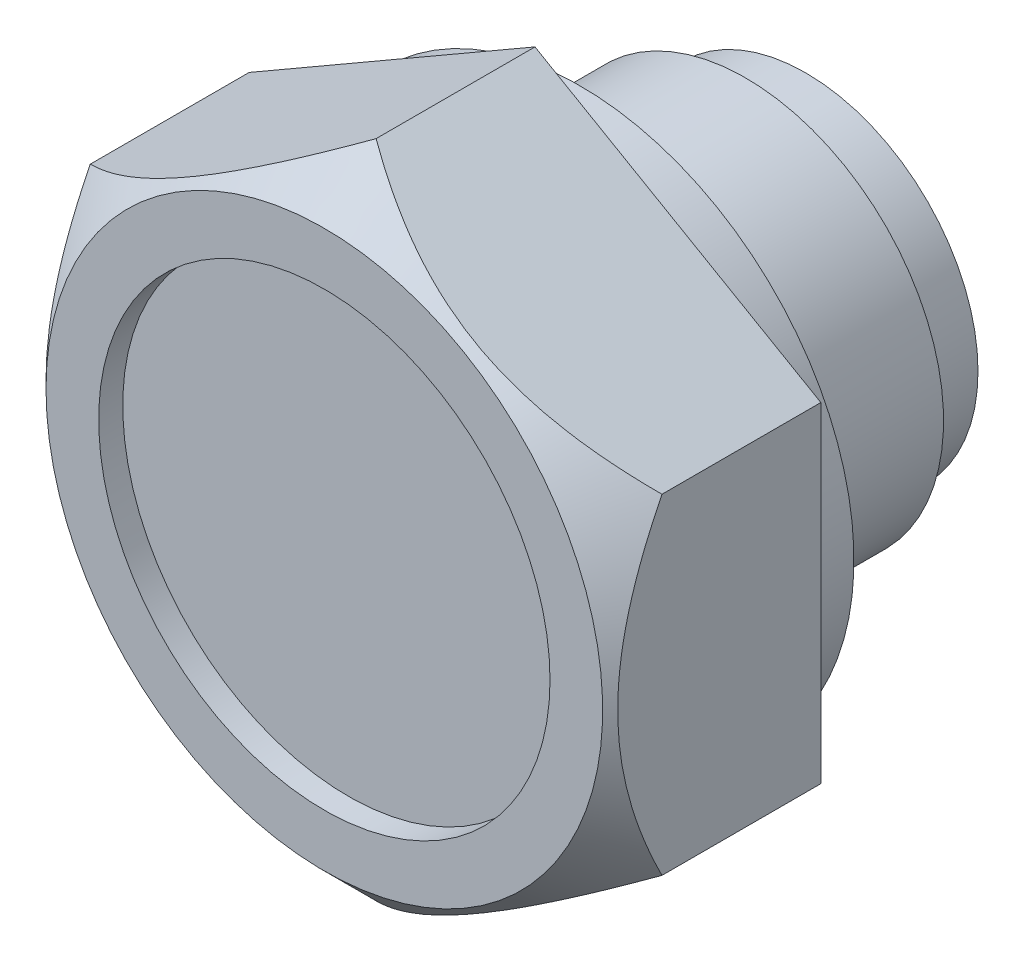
ISO-10303-21;
HEADER;
FILE_DESCRIPTION(('STEP AP214'),'2;1');
FILE_NAME('part.step','',(''),(''),'','','');
FILE_SCHEMA(('AUTOMOTIVE_DESIGN { 1 0 10303 214 1 1 1 1 }'));
ENDSEC;
DATA;
#1=APPLICATION_CONTEXT('core data for automotive mechanical design processes');
#2=APPLICATION_PROTOCOL_DEFINITION('international standard','automotive_design',2000,#1);
#3=PRODUCT_CONTEXT('',#1,'mechanical');
#4=PRODUCT('Part','Part','',(#3));
#5=PRODUCT_RELATED_PRODUCT_CATEGORY('part','',(#4));
#6=PRODUCT_DEFINITION_FORMATION('','',#4);
#7=PRODUCT_DEFINITION_CONTEXT('part definition',#1,'design');
#8=PRODUCT_DEFINITION('design','',#6,#7);
#9=PRODUCT_DEFINITION_SHAPE('','',#8);
#10=(LENGTH_UNIT() NAMED_UNIT(*) SI_UNIT(.MILLI.,.METRE.));
#11=(NAMED_UNIT(*) PLANE_ANGLE_UNIT() SI_UNIT($,.RADIAN.));
#12=(NAMED_UNIT(*) SI_UNIT($,.STERADIAN.) SOLID_ANGLE_UNIT());
#13=UNCERTAINTY_MEASURE_WITH_UNIT(LENGTH_MEASURE(1.E-05),#10,'distance_accuracy_value','');
#14=(GEOMETRIC_REPRESENTATION_CONTEXT(3) GLOBAL_UNCERTAINTY_ASSIGNED_CONTEXT((#13)) GLOBAL_UNIT_ASSIGNED_CONTEXT((#10,
#11,#12)) REPRESENTATION_CONTEXT('',''));
#15=CARTESIAN_POINT('',(0.,0.,0.));
#16=DIRECTION('',(0.,0.,1.));
#17=DIRECTION('',(1.,0.,0.));
#18=AXIS2_PLACEMENT_3D('',#15,#16,#17);
#19=CARTESIAN_POINT('',(0.,9.1,1.5));
#20=DIRECTION('',(0.,0.,-1.));
#21=DIRECTION('',(-1.,0.,0.));
#22=AXIS2_PLACEMENT_3D('',#19,#20,#21);
#23=PLANE('',#22);
#24=CARTESIAN_POINT('',(0.,0.,1.5));
#25=DIRECTION('',(0.,0.,-1.));
#26=DIRECTION('',(-1.,0.,0.));
#27=AXIS2_PLACEMENT_3D('',#24,#25,#26);
#28=CIRCLE('',#27,9.1);
#29=CARTESIAN_POINT('',(-9.1,0.,1.5));
#30=VERTEX_POINT('',#29);
#31=EDGE_CURVE('E194',#30,#30,#28,.T.);
#32=ORIENTED_EDGE('',*,*,#31,.F.);
#33=EDGE_LOOP('',(#32));
#34=FACE_BOUND('',#33,.T.);
#35=DIRECTION('',(-0.866025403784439,-0.5,0.));
#36=VECTOR('',#35,1.);
#37=CARTESIAN_POINT('',(-0.809584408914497,10.5022413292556,1.5));
#38=LINE('',#37,#36);
#39=CARTESIAN_POINT('',(-2.35150440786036E-11,10.9696551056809,1.5));
#40=VERTEX_POINT('',#39);
#41=CARTESIAN_POINT('',(-9.49999999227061,5.4848275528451,1.5));
#42=VERTEX_POINT('',#41);
#43=EDGE_CURVE('E9',#40,#42,#38,.T.);
#44=ORIENTED_EDGE('',*,*,#43,.F.);
#45=DIRECTION('',(-0.866025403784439,0.5,0.));
#46=VECTOR('',#45,1.);
#47=CARTESIAN_POINT('',(0.809584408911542,10.5022413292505,1.5));
#48=LINE('',#47,#46);
#49=CARTESIAN_POINT('',(9.49999999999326,5.48482753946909,1.5));
#50=VERTEX_POINT('',#49);
#51=EDGE_CURVE('E22',#50,#40,#48,.T.);
#52=ORIENTED_EDGE('',*,*,#51,.F.);
#53=DIRECTION('',(7.05455308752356E-10,1.,0.));
#54=VECTOR('',#53,1.);
#55=CARTESIAN_POINT('',(9.5000000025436,9.0999999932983,1.5));
#56=LINE('',#55,#54);
#57=CARTESIAN_POINT('',(9.49999999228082,-5.48482755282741,1.5));
#58=VERTEX_POINT('',#57);
#59=EDGE_CURVE('E205',#58,#50,#56,.T.);
#60=ORIENTED_EDGE('',*,*,#59,.F.);
#61=DIRECTION('',(0.866025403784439,0.5,0.));
#62=VECTOR('',#61,1.);
#63=CARTESIAN_POINT('',(8.69041558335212,-5.9522413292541,1.5));
#64=LINE('',#63,#62);
#65=CARTESIAN_POINT('',(7.9060022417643E-12,-10.9696551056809,1.5));
#66=VERTEX_POINT('',#65);
#67=EDGE_CURVE('E37',#66,#58,#64,.T.);
#68=ORIENTED_EDGE('',*,*,#67,.F.);
#69=DIRECTION('',(0.866025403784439,-0.5,0.));
#70=VECTOR('',#69,1.);
#71=CARTESIAN_POINT('',(-8.69041558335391,-5.9522413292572,1.5));
#72=LINE('',#71,#70);
#73=CARTESIAN_POINT('',(-9.49999999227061,-5.48482755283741,1.5));
#74=VERTEX_POINT('',#73);
#75=EDGE_CURVE('E65',#74,#66,#72,.T.);
#76=ORIENTED_EDGE('',*,*,#75,.F.);
#77=DIRECTION('',(0.,-1.,0.));
#78=VECTOR('',#77,1.);
#79=CARTESIAN_POINT('',(-9.49999999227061,9.1,1.5));
#80=LINE('',#79,#78);
#81=EDGE_CURVE('E66',#42,#74,#80,.T.);
#82=ORIENTED_EDGE('',*,*,#81,.F.);
#83=EDGE_LOOP('',(#44,#52,#60,#68,#76,#82));
#84=FACE_BOUND('',#83,.T.);
#85=ADVANCED_FACE('F14',(#34,#84),#23,.T.);
#86=CARTESIAN_POINT('',(0.,0.,-7.5));
#87=DIRECTION('',(0.,0.,-1.));
#88=DIRECTION('',(-1.,0.,0.));
#89=AXIS2_PLACEMENT_3D('',#86,#87,#88);
#90=PLANE('',#89);
#91=CARTESIAN_POINT('',(0.,0.,-7.5));
#92=DIRECTION('',(0.,0.,-1.));
#93=DIRECTION('',(-1.,0.,0.));
#94=AXIS2_PLACEMENT_3D('',#91,#92,#93);
#95=CIRCLE('',#94,5.72250000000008);
#96=CARTESIAN_POINT('',(-5.72250000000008,0.,-7.5));
#97=VERTEX_POINT('',#96);
#98=EDGE_CURVE('E213',#97,#97,#95,.T.);
#99=ORIENTED_EDGE('',*,*,#98,.T.);
#100=EDGE_LOOP('',(#99));
#101=FACE_BOUND('',#100,.T.);
#102=ADVANCED_FACE('F16',(#101),#90,.T.);
#103=CARTESIAN_POINT('',(0.,0.,-9.68228561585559));
#104=DIRECTION('',(0.,0.,-1.));
#105=DIRECTION('',(-1.,0.,0.));
#106=AXIS2_PLACEMENT_3D('',#103,#104,#105);
#107=CYLINDRICAL_SURFACE('',#106,9.1);
#108=ORIENTED_EDGE('',*,*,#31,.T.);
#109=EDGE_LOOP('',(#108));
#110=FACE_BOUND('',#109,.T.);
#111=CARTESIAN_POINT('',(0.,0.,0.));
#112=DIRECTION('',(0.,0.,-1.));
#113=DIRECTION('',(-1.,0.,0.));
#114=AXIS2_PLACEMENT_3D('',#111,#112,#113);
#115=CIRCLE('',#114,9.1);
#116=CARTESIAN_POINT('',(-9.1,0.,0.));
#117=VERTEX_POINT('',#116);
#118=EDGE_CURVE('E195',#117,#117,#115,.T.);
#119=ORIENTED_EDGE('',*,*,#118,.F.);
#120=EDGE_LOOP('',(#119));
#121=FACE_BOUND('',#120,.T.);
#122=ADVANCED_FACE('F176',(#110,#121),#107,.T.);
#123=CARTESIAN_POINT('',(0.,6.5785,0.));
#124=DIRECTION('',(0.,0.,-1.));
#125=DIRECTION('',(-1.,0.,0.));
#126=AXIS2_PLACEMENT_3D('',#123,#124,#125);
#127=PLANE('',#126);
#128=ORIENTED_EDGE('',*,*,#118,.T.);
#129=EDGE_LOOP('',(#128));
#130=FACE_BOUND('',#129,.T.);
#131=CARTESIAN_POINT('',(0.,0.,0.));
#132=DIRECTION('',(0.,0.,-1.));
#133=DIRECTION('',(-1.,0.,0.));
#134=AXIS2_PLACEMENT_3D('',#131,#132,#133);
#135=CIRCLE('',#134,6.57850000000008);
#136=CARTESIAN_POINT('',(-6.57850000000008,0.,0.));
#137=VERTEX_POINT('',#136);
#138=EDGE_CURVE('E200',#137,#137,#135,.T.);
#139=ORIENTED_EDGE('',*,*,#138,.F.);
#140=EDGE_LOOP('',(#139));
#141=FACE_BOUND('',#140,.T.);
#142=ADVANCED_FACE('F173',(#130,#141),#127,.T.);
#143=CARTESIAN_POINT('',(0.,0.,-9.68228561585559));
#144=DIRECTION('',(0.,0.,-1.));
#145=DIRECTION('',(-1.,0.,0.));
#146=AXIS2_PLACEMENT_3D('',#143,#144,#145);
#147=CYLINDRICAL_SURFACE('',#146,6.57850000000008);
#148=CARTESIAN_POINT('',(0.,0.,-5.5));
#149=DIRECTION('',(0.,0.,-1.));
#150=DIRECTION('',(-1.,0.,0.));
#151=AXIS2_PLACEMENT_3D('',#148,#149,#150);
#152=CIRCLE('',#151,6.5785);
#153=CARTESIAN_POINT('',(-6.5785,0.,-5.5));
#154=VERTEX_POINT('',#153);
#155=EDGE_CURVE('E218',#154,#154,#152,.T.);
#156=ORIENTED_EDGE('',*,*,#155,.F.);
#157=EDGE_LOOP('',(#156));
#158=FACE_BOUND('',#157,.T.);
#159=ORIENTED_EDGE('',*,*,#138,.T.);
#160=EDGE_LOOP('',(#159));
#161=FACE_BOUND('',#160,.T.);
#162=ADVANCED_FACE('F169',(#158,#161),#147,.T.);
#163=CARTESIAN_POINT('',(0.,5.7225,-5.5));
#164=DIRECTION('',(0.,0.,-1.));
#165=DIRECTION('',(-1.,0.,0.));
#166=AXIS2_PLACEMENT_3D('',#163,#164,#165);
#167=PLANE('',#166);
#168=ORIENTED_EDGE('',*,*,#155,.T.);
#169=EDGE_LOOP('',(#168));
#170=FACE_BOUND('',#169,.T.);
#171=CARTESIAN_POINT('',(0.,0.,-5.5));
#172=DIRECTION('',(0.,0.,-1.));
#173=DIRECTION('',(-1.,0.,0.));
#174=AXIS2_PLACEMENT_3D('',#171,#172,#173);
#175=CIRCLE('',#174,5.72250000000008);
#176=CARTESIAN_POINT('',(-5.72250000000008,0.,-5.5));
#177=VERTEX_POINT('',#176);
#178=EDGE_CURVE('E215',#177,#177,#175,.T.);
#179=ORIENTED_EDGE('',*,*,#178,.F.);
#180=EDGE_LOOP('',(#179));
#181=FACE_BOUND('',#180,.T.);
#182=ADVANCED_FACE('F165',(#170,#181),#167,.T.);
#183=CARTESIAN_POINT('',(0.,0.,-9.68228561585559));
#184=DIRECTION('',(0.,0.,-1.));
#185=DIRECTION('',(-1.,0.,0.));
#186=AXIS2_PLACEMENT_3D('',#183,#184,#185);
#187=CYLINDRICAL_SURFACE('',#186,5.72250000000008);
#188=ORIENTED_EDGE('',*,*,#98,.F.);
#189=EDGE_LOOP('',(#188));
#190=FACE_BOUND('',#189,.T.);
#191=ORIENTED_EDGE('',*,*,#178,.T.);
#192=EDGE_LOOP('',(#191));
#193=FACE_BOUND('',#192,.T.);
#194=ADVANCED_FACE('F162',(#190,#193),#187,.T.);
#195=CARTESIAN_POINT('',(-9.49999999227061,5.48482755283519,-7.5));
#196=DIRECTION('',(0.5,-0.866025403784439,0.));
#197=DIRECTION('',(-0.866025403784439,-0.5,0.));
#198=AXIS2_PLACEMENT_3D('',#195,#196,#197);
#199=PLANE('',#198);
#200=CARTESIAN_POINT('',(0.000199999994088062,10.9697705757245,6.7802294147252));
#201=CARTESIAN_POINT('',(-0.163127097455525,10.875473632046,6.87451305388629));
#202=CARTESIAN_POINT('',(-0.32773331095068,10.7804381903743,6.96591968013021));
#203=CARTESIAN_POINT('',(-0.659703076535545,10.588775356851,7.14206501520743));
#204=CARTESIAN_POINT('',(-0.827068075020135,10.492147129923,7.22680008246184));
#205=CARTESIAN_POINT('',(-1.16554392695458,10.2967280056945,7.38904726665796));
#206=CARTESIAN_POINT('',(-1.33667074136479,10.1979278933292,7.46651524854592));
#207=CARTESIAN_POINT('',(-1.68173507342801,9.99870490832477,7.61254572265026));
#208=CARTESIAN_POINT('',(-1.85567215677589,9.89828228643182,7.6811095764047));
#209=CARTESIAN_POINT('',(-2.20356038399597,9.6974289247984,7.80716241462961));
#210=CARTESIAN_POINT('',(-2.37746877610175,9.59702286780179,7.86480781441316));
#211=CARTESIAN_POINT('',(-2.7277234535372,9.39480323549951,7.96916953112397));
#212=CARTESIAN_POINT('',(-2.90406947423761,9.29298981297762,8.01588702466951));
#213=CARTESIAN_POINT('',(-3.25844512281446,9.08839093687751,8.09721676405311));
#214=CARTESIAN_POINT('',(-3.43647001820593,8.98560821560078,8.13185625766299));
#215=CARTESIAN_POINT('',(-3.79401438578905,8.77917987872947,8.18826883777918));
#216=CARTESIAN_POINT('',(-3.97353363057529,8.67553439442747,8.21004384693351));
#217=CARTESIAN_POINT('',(-4.41100623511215,8.42295946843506,8.24655435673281));
#218=CARTESIAN_POINT('',(-4.66943244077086,8.27375702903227,8.25421609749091));
#219=CARTESIAN_POINT('',(-5.18581747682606,7.97562198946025,8.24135626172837));
#220=CARTESIAN_POINT('',(-5.44377611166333,7.82668950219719,8.22082480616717));
#221=CARTESIAN_POINT('',(-5.95726173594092,7.53022843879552,8.15279045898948));
#222=CARTESIAN_POINT('',(-6.21278568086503,7.38270162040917,8.10525740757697));
#223=CARTESIAN_POINT('',(-6.71944160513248,7.09018368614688,7.98580361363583));
#224=CARTESIAN_POINT('',(-6.97057391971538,6.94519237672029,7.9138847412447));
#225=CARTESIAN_POINT('',(-7.41636798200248,6.68781305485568,7.76592936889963));
#226=CARTESIAN_POINT('',(-7.61201705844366,6.57485500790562,7.69378482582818));
#227=CARTESIAN_POINT('',(-7.99980326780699,6.35096653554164,7.53787046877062));
#228=CARTESIAN_POINT('',(-8.19194029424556,6.24003617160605,7.45410030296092));
#229=CARTESIAN_POINT('',(-8.57209722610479,6.02055246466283,7.27681237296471));
#230=CARTESIAN_POINT('',(-8.76012794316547,5.91199287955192,7.18332526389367));
#231=CARTESIAN_POINT('',(-9.13270777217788,5.69688381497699,6.98783068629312));
#232=CARTESIAN_POINT('',(-9.31725893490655,5.59033315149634,6.8858284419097));
#233=CARTESIAN_POINT('',(-9.50019999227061,5.48471208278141,6.78022941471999));
#234=B_SPLINE_CURVE_WITH_KNOTS('',3,(#200,#201,#202,#203,#204,#205,#206,#207,#208,#209,#210,
#211,#212,#213,#214,#215,#216,#217,#218,#219,#220,#221,#222,#223,#224,#225,#226,#227,#228,#229,
#230,#231,#232,#233),.UNSPECIFIED.,.F.,.F.,(4,2,2,2,2,2,2,2,2,2,2,2,2,2,2,2,4),(0.,
0.632572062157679,1.2654870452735,1.90202596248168,2.53846743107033,3.16495668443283,
3.79137845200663,4.41637773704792,5.04128358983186,5.9353975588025,6.82982490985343,
7.72525327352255,8.62061298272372,9.33174688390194,10.0429023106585,10.7518786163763,
11.4604231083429),.UNSPECIFIED.);
#235=CARTESIAN_POINT('',(-5.91193760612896E-12,10.9696551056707,6.7803448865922));
#236=VERTEX_POINT('',#235);
#237=CARTESIAN_POINT('',(-9.49999999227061,5.48482755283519,6.7803448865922));
#238=VERTEX_POINT('',#237);
#239=EDGE_CURVE('E148',#236,#238,#234,.T.);
#240=ORIENTED_EDGE('',*,*,#239,.F.);
#241=DIRECTION('',(0.,0.,1.));
#242=VECTOR('',#241,1.);
#243=CARTESIAN_POINT('',(-5.91193760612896E-12,10.9696551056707,-7.5));
#244=LINE('',#243,#242);
#245=EDGE_CURVE('E94',#40,#236,#244,.T.);
#246=ORIENTED_EDGE('',*,*,#245,.F.);
#247=ORIENTED_EDGE('',*,*,#43,.T.);
#248=DIRECTION('',(0.,0.,1.));
#249=VECTOR('',#248,1.);
#250=CARTESIAN_POINT('',(-9.49999999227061,5.48482755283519,-7.5));
#251=LINE('',#250,#249);
#252=EDGE_CURVE('E74',#42,#238,#251,.T.);
#253=ORIENTED_EDGE('',*,*,#252,.T.);
#254=EDGE_LOOP('',(#240,#246,#247,#253));
#255=FACE_BOUND('',#254,.T.);
#256=ADVANCED_FACE('F159',(#255),#199,.F.);
#257=CARTESIAN_POINT('',(-5.91193760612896E-12,10.9696551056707,-7.5));
#258=DIRECTION('',(-0.5,-0.866025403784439,0.));
#259=DIRECTION('',(-0.866025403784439,0.5,0.));
#260=AXIS2_PLACEMENT_3D('',#257,#258,#259);
#261=PLANE('',#260);
#262=CARTESIAN_POINT('',(9.50019999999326,5.4847120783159,6.7802294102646));
#263=CARTESIAN_POINT('',(9.3368729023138,5.5790090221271,6.8745130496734));
#264=CARTESIAN_POINT('',(9.17226668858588,5.67404446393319,6.96591967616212));
#265=CARTESIAN_POINT('',(8.84029692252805,5.8657072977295,7.14206501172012));
#266=CARTESIAN_POINT('',(8.67293192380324,5.96233552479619,7.22680007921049));
#267=CARTESIAN_POINT('',(8.33445607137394,6.15775464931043,7.38904726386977));
#268=CARTESIAN_POINT('',(8.16332925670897,6.25655476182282,7.46651524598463));
#269=CARTESIAN_POINT('',(7.81826492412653,6.45577774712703,7.61254572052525));
#270=CARTESIAN_POINT('',(7.6443278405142,6.55620036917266,7.68110957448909));
#271=CARTESIAN_POINT('',(7.29643961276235,6.7570537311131,7.80716241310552));
#272=CARTESIAN_POINT('',(7.12253122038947,6.85745978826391,7.86480781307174));
#273=CARTESIAN_POINT('',(6.77227654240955,7.05967942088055,7.96916953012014));
#274=CARTESIAN_POINT('',(6.59593052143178,7.16149284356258,8.01588702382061));
#275=CARTESIAN_POINT('',(6.24155487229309,7.36609171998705,8.09721676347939));
#276=CARTESIAN_POINT('',(6.06352997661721,7.46887444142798,8.13185625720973));
#277=CARTESIAN_POINT('',(5.70598560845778,7.67530277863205,8.18826883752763));
#278=CARTESIAN_POINT('',(5.52646636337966,7.77894826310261,8.21004384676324));
#279=CARTESIAN_POINT('',(5.08899375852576,8.03152318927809,8.24655435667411));
#280=CARTESIAN_POINT('',(4.83056755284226,8.18072562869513,8.25421609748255));
#281=CARTESIAN_POINT('',(4.31418251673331,8.47886066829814,8.24135626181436));
#282=CARTESIAN_POINT('',(4.05622388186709,8.62779315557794,8.22082480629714));
#283=CARTESIAN_POINT('',(3.54273825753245,8.92425421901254,8.15279045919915));
#284=CARTESIAN_POINT('',(3.2872143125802,9.07178103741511,8.10525740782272));
#285=CARTESIAN_POINT('',(2.78055838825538,9.36429897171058,7.98580361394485));
#286=CARTESIAN_POINT('',(2.52942607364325,9.50929028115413,7.91388474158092));
#287=CARTESIAN_POINT('',(2.08363201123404,9.76666960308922,7.76592936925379));
#288=CARTESIAN_POINT('',(1.88798293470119,9.87962765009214,7.69378482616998));
#289=CARTESIAN_POINT('',(1.50019672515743,10.1035161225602,7.53787046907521));
#290=CARTESIAN_POINT('',(1.30805969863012,10.2144464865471,7.45410030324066));
#291=CARTESIAN_POINT('',(0.927902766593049,10.433930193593,7.27681237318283));
#292=CARTESIAN_POINT('',(0.739872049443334,10.5424897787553,7.18332526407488));
#293=CARTESIAN_POINT('',(0.367292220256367,10.757598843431,6.98783068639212));
#294=CARTESIAN_POINT('',(0.182741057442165,10.864149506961,6.88582844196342));
#295=CARTESIAN_POINT('',(-0.000200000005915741,10.9697705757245,6.7802294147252));
#296=B_SPLINE_CURVE_WITH_KNOTS('',3,(#262,#263,#264,#265,#266,#267,#268,#269,#270,#271,#272,
#273,#274,#275,#276,#277,#278,#279,#280,#281,#282,#283,#284,#285,#286,#287,#288,#289,#290,#291,
#292,#293,#294,#295),.UNSPECIFIED.,.F.,.F.,(4,2,2,2,2,2,2,2,2,2,2,2,2,2,2,2,4),(0.,
0.632572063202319,1.2654870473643,1.90202596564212,2.5384674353,3.16495668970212,
3.79137845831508,4.4163777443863,5.04128359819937,5.93539756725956,6.82982491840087,
7.72525328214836,8.62061299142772,9.33174689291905,10.0429023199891,10.7518786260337,
11.4604231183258),.UNSPECIFIED.);
#297=CARTESIAN_POINT('',(9.49999999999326,5.4848275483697,6.7803448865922));
#298=VERTEX_POINT('',#297);
#299=EDGE_CURVE('E141',#298,#236,#296,.T.);
#300=ORIENTED_EDGE('',*,*,#299,.F.);
#301=DIRECTION('',(0.,0.,1.));
#302=VECTOR('',#301,1.);
#303=CARTESIAN_POINT('',(9.49999999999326,5.4848275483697,-7.5));
#304=LINE('',#303,#302);
#305=EDGE_CURVE('E91',#50,#298,#304,.T.);
#306=ORIENTED_EDGE('',*,*,#305,.F.);
#307=ORIENTED_EDGE('',*,*,#51,.T.);
#308=ORIENTED_EDGE('',*,*,#245,.T.);
#309=EDGE_LOOP('',(#300,#306,#307,#308));
#310=FACE_BOUND('',#309,.T.);
#311=ADVANCED_FACE('F154',(#310),#261,.F.);
#312=CARTESIAN_POINT('',(9.49999999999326,5.4848275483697,-7.5));
#313=DIRECTION('',(-1.,7.05455308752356E-10,0.));
#314=DIRECTION('',(7.05455308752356E-10,1.,0.));
#315=AXIS2_PLACEMENT_3D('',#312,#313,#314);
#316=PLANE('',#315);
#317=CARTESIAN_POINT('',(9.49999998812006,-11.3457131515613,2.9521891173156));
#318=CARTESIAN_POINT('',(9.49999998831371,-11.0712135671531,3.16260485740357));
#319=CARTESIAN_POINT('',(9.49999998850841,-10.795223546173,3.37110700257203));
#320=CARTESIAN_POINT('',(9.49999998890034,-10.2396575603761,3.78341323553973));
#321=CARTESIAN_POINT('',(9.49999998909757,-9.96008075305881,3.98721618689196));
#322=CARTESIAN_POINT('',(9.49999998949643,-9.3946920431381,4.39070371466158));
#323=CARTESIAN_POINT('',(9.49999998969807,-9.10884866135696,4.59034432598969));
#324=CARTESIAN_POINT('',(9.49999999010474,-8.53238522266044,4.98258231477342));
#325=CARTESIAN_POINT('',(9.49999999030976,-8.241765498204,5.17518017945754));
#326=CARTESIAN_POINT('',(9.4999999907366,-7.63671605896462,5.56343906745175));
#327=CARTESIAN_POINT('',(9.49999999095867,-7.32192921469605,5.75854635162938));
#328=CARTESIAN_POINT('',(9.49999999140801,-6.68497023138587,6.13651280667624));
#329=CARTESIAN_POINT('',(9.49999999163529,-6.36279687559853,6.31936993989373));
#330=CARTESIAN_POINT('',(9.49999999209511,-5.71099984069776,6.66893162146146));
#331=CARTESIAN_POINT('',(9.49999999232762,-5.38140180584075,6.83568361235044));
#332=CARTESIAN_POINT('',(9.49999999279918,-4.71295092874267,7.14929937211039));
#333=CARTESIAN_POINT('',(9.49999999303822,-4.37410250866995,7.29617245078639));
#334=CARTESIAN_POINT('',(9.49999999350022,-3.71920448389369,7.55193430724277));
#335=CARTESIAN_POINT('',(9.49999999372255,-3.4040565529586,7.66310834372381));
#336=CARTESIAN_POINT('',(9.4999999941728,-2.76581761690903,7.86022157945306));
#337=CARTESIAN_POINT('',(9.49999999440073,-2.44272609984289,7.94615914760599));
#338=CARTESIAN_POINT('',(9.49999999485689,-1.79610559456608,8.08674929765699));
#339=CARTESIAN_POINT('',(9.49999999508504,-1.47270082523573,8.14196366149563));
#340=CARTESIAN_POINT('',(9.49999999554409,-0.821982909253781,8.21997024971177));
#341=CARTESIAN_POINT('',(9.49999999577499,-0.494670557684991,8.24276896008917));
#342=CARTESIAN_POINT('',(9.49999999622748,0.146743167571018,8.25405061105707));
#343=CARTESIAN_POINT('',(9.49999999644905,0.46082012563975,8.24393888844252));
#344=CARTESIAN_POINT('',(9.49999999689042,1.08647769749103,8.19316178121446));
#345=CARTESIAN_POINT('',(9.49999999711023,1.39805807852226,8.15249358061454));
#346=CARTESIAN_POINT('',(9.49999999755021,2.02174480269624,8.04219578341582));
#347=CARTESIAN_POINT('',(9.49999999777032,2.33375985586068,7.97205855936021));
#348=CARTESIAN_POINT('',(9.49999999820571,2.95093459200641,7.80668398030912));
#349=CARTESIAN_POINT('',(9.49999999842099,3.25609470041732,7.71144818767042));
#350=CARTESIAN_POINT('',(9.49999999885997,3.87836919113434,7.49322629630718));
#351=CARTESIAN_POINT('',(9.49999999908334,4.19499042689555,7.36884953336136));
#352=CARTESIAN_POINT('',(9.49999999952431,4.82007561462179,7.1009004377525));
#353=CARTESIAN_POINT('',(9.49999999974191,5.1285357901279,6.95731939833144));
#354=CARTESIAN_POINT('',(9.5000000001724,5.73876429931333,6.654368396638));
#355=CARTESIAN_POINT('',(9.50000000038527,6.04050820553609,6.49494962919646));
#356=CARTESIAN_POINT('',(9.50000000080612,6.63707674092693,6.16383409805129));
#357=CARTESIAN_POINT('',(9.50000000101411,6.93190243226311,5.99213923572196));
#358=CARTESIAN_POINT('',(9.50000000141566,7.50111584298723,5.64760336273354));
#359=CARTESIAN_POINT('',(9.50000000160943,7.77579338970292,5.4752386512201));
#360=CARTESIAN_POINT('',(9.50000000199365,8.32042982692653,5.12318704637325));
#361=CARTESIAN_POINT('',(9.50000000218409,8.59038836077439,4.94349960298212));
#362=CARTESIAN_POINT('',(9.50000000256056,9.12403033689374,4.57957545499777));
#363=CARTESIAN_POINT('',(9.5000000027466,9.38774679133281,4.39538698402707));
#364=CARTESIAN_POINT('',(9.50000000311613,9.91156408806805,4.02208356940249));
#365=CARTESIAN_POINT('',(9.50000000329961,10.1716659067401,3.83296999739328));
#366=CARTESIAN_POINT('',(9.50000000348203,10.4302518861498,3.6418408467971));
#367=B_SPLINE_CURVE_WITH_KNOTS('',3,(#317,#318,#319,#320,#321,#322,#323,#324,#325,#326,#327,
#328,#329,#330,#331,#332,#333,#334,#335,#336,#337,#338,#339,#340,#341,#342,#343,#344,#345,#346,
#347,#348,#349,#350,#351,#352,#353,#354,#355,#356,#357,#358,#359,#360,#361,#362,#363,#364,#365,
#366),.UNSPECIFIED.,.F.,.F.,(4,2,2,2,2,2,2,2,2,2,2,2,2,2,2,2,2,2,2,2,2,2,2,2,4),(0.,
1.03762389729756,2.07549615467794,3.12138434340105,4.16720003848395,5.27802227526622,
6.38902882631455,7.49665580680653,8.60376224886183,9.60544233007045,10.6071871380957,
11.5899563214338,12.5725288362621,13.5137031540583,14.4549642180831,15.4131508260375,
16.3712778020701,17.3910167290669,18.4112195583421,19.434669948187,20.4579621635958,
21.4306652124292,22.4034414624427,23.3683910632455,24.3330747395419),.UNSPECIFIED.);
#368=CARTESIAN_POINT('',(9.49999999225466,-5.48482755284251,6.7803448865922));
#369=VERTEX_POINT('',#368);
#370=EDGE_CURVE('E134',#369,#298,#367,.T.);
#371=ORIENTED_EDGE('',*,*,#370,.F.);
#372=DIRECTION('',(0.,0.,1.));
#373=VECTOR('',#372,1.);
#374=CARTESIAN_POINT('',(9.49999999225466,-5.48482755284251,-7.5));
#375=LINE('',#374,#373);
#376=EDGE_CURVE('E83',#58,#369,#375,.T.);
#377=ORIENTED_EDGE('',*,*,#376,.F.);
#378=ORIENTED_EDGE('',*,*,#59,.T.);
#379=ORIENTED_EDGE('',*,*,#305,.T.);
#380=EDGE_LOOP('',(#371,#377,#378,#379));
#381=FACE_BOUND('',#380,.T.);
#382=ADVANCED_FACE('F158',(#381),#316,.F.);
#383=CARTESIAN_POINT('',(9.49999999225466,-5.48482755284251,-7.5));
#384=DIRECTION('',(-0.5,0.866025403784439,0.));
#385=DIRECTION('',(0.866025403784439,0.5,0.));
#386=AXIS2_PLACEMENT_3D('',#383,#384,#385);
#387=PLANE('',#386);
#388=CARTESIAN_POINT('',(-0.000200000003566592,-10.9697705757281,6.7802294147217));
#389=CARTESIAN_POINT('',(0.163127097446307,-10.8754736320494,6.87451305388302));
#390=CARTESIAN_POINT('',(0.327733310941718,-10.7804381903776,6.96591968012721));
#391=CARTESIAN_POINT('',(0.659703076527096,-10.588775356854,7.14206501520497));
#392=CARTESIAN_POINT('',(0.827068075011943,-10.4921471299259,7.22680008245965));
#393=CARTESIAN_POINT('',(1.16554392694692,-10.296728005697,7.38904726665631));
#394=CARTESIAN_POINT('',(1.33667074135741,-10.1979278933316,7.46651524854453));
#395=CARTESIAN_POINT('',(1.68173507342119,-9.99870490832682,7.61254572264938));
#396=CARTESIAN_POINT('',(1.85567215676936,-9.8982822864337,7.68110957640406));
#397=CARTESIAN_POINT('',(2.20356038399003,-9.69742892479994,7.80716241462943));
#398=CARTESIAN_POINT('',(2.37746877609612,-9.59702286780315,7.8648078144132));
#399=CARTESIAN_POINT('',(2.7277234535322,-9.39480323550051,7.96916953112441));
#400=CARTESIAN_POINT('',(2.90406947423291,-9.29298981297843,8.01588702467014));
#401=CARTESIAN_POINT('',(3.25844512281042,-9.08839093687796,8.09721676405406));
#402=CARTESIAN_POINT('',(3.43647001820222,-8.98560821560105,8.13185625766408));
#403=CARTESIAN_POINT('',(3.79401438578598,-8.77917987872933,8.18826883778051));
#404=CARTESIAN_POINT('',(3.97353363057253,-8.67553439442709,8.21004384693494));
#405=CARTESIAN_POINT('',(4.4110062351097,-8.42295946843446,8.24655435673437));
#406=CARTESIAN_POINT('',(4.66943244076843,-8.27375702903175,8.25421609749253));
#407=CARTESIAN_POINT('',(5.18581747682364,-7.97562198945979,8.2413562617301));
#408=CARTESIAN_POINT('',(5.44377611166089,-7.82668950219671,8.22082480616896));
#409=CARTESIAN_POINT('',(5.95726173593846,-7.53022843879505,8.15279045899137));
#410=CARTESIAN_POINT('',(6.21278568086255,-7.38270162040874,8.1052574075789));
#411=CARTESIAN_POINT('',(6.71944160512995,-7.09018368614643,7.98580361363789));
#412=CARTESIAN_POINT('',(6.97057391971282,-6.94519237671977,7.91388474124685));
#413=CARTESIAN_POINT('',(7.4163679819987,-6.68781305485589,7.76592936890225));
#414=CARTESIAN_POINT('',(7.61201705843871,-6.57485500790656,7.69378482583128));
#415=CARTESIAN_POINT('',(7.99980326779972,-6.35096653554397,7.53787046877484));
#416=CARTESIAN_POINT('',(8.19194029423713,-6.24003617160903,7.4541003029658));
#417=CARTESIAN_POINT('',(8.57209722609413,-6.02055246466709,7.27681237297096));
#418=CARTESIAN_POINT('',(8.76012794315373,-5.91199287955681,7.18332526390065));
#419=CARTESIAN_POINT('',(9.132707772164,-5.69688381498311,6.98783068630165));
#420=CARTESIAN_POINT('',(9.31725893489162,-5.59033315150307,6.88582844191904));
#421=CARTESIAN_POINT('',(9.50019999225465,-5.4847120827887,6.78022941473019));
#422=B_SPLINE_CURVE_WITH_KNOTS('',3,(#388,#389,#390,#391,#392,#393,#394,#395,#396,#397,#398,
#399,#400,#401,#402,#403,#404,#405,#406,#407,#408,#409,#410,#411,#412,#413,#414,#415,#416,#417,
#418,#419,#420,#421),.UNSPECIFIED.,.F.,.F.,(4,2,2,2,2,2,2,2,2,2,2,2,2,2,2,2,4),(0.,
0.632572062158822,1.26548704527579,1.90202596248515,2.53846743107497,3.16495668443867,
3.79137845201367,4.41637773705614,5.04128358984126,5.93539755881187,6.82982490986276,
7.72525327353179,8.62061298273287,9.33174688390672,10.0429023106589,10.7518786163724,
11.4604231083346),.UNSPECIFIED.);
#423=CARTESIAN_POINT('',(-3.56659146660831E-12,-10.9696551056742,6.7803448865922));
#424=VERTEX_POINT('',#423);
#425=EDGE_CURVE('E127',#424,#369,#422,.T.);
#426=ORIENTED_EDGE('',*,*,#425,.F.);
#427=DIRECTION('',(0.,0.,1.));
#428=VECTOR('',#427,1.);
#429=CARTESIAN_POINT('',(-3.56659146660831E-12,-10.9696551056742,-7.5));
#430=LINE('',#429,#428);
#431=EDGE_CURVE('E81',#66,#424,#430,.T.);
#432=ORIENTED_EDGE('',*,*,#431,.F.);
#433=ORIENTED_EDGE('',*,*,#67,.T.);
#434=ORIENTED_EDGE('',*,*,#376,.T.);
#435=EDGE_LOOP('',(#426,#432,#433,#434));
#436=FACE_BOUND('',#435,.T.);
#437=ADVANCED_FACE('F235',(#436),#387,.F.);
#438=CARTESIAN_POINT('',(-3.56659146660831E-12,-10.9696551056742,-7.5));
#439=DIRECTION('',(0.5,0.866025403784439,0.));
#440=DIRECTION('',(0.866025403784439,-0.5,0.));
#441=AXIS2_PLACEMENT_3D('',#438,#439,#440);
#442=PLANE('',#441);
#443=CARTESIAN_POINT('',(-9.50019999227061,-5.4847120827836,6.7802294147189));
#444=CARTESIAN_POINT('',(-9.33687289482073,-5.57900902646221,6.87451305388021));
#445=CARTESIAN_POINT('',(-9.17226668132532,-5.67404446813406,6.96591968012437));
#446=CARTESIAN_POINT('',(-8.84029691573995,-5.86570730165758,7.14206501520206));
#447=CARTESIAN_POINT('',(-8.67293191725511,-5.96233552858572,7.2268000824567));
#448=CARTESIAN_POINT('',(-8.33445606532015,-6.15775465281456,7.38904726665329));
#449=CARTESIAN_POINT('',(-8.16332925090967,-6.25655476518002,7.46651524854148));
#450=CARTESIAN_POINT('',(-7.81826491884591,-6.45577775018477,7.61254572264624));
#451=CARTESIAN_POINT('',(-7.64432783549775,-6.55620037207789,7.68110957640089));
#452=CARTESIAN_POINT('',(-7.2964396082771,-6.75705373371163,7.80716241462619));
#453=CARTESIAN_POINT('',(-7.12253121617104,-6.8574597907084,7.86480781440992));
#454=CARTESIAN_POINT('',(-6.772276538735,-7.05967942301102,7.96916953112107));
#455=CARTESIAN_POINT('',(-6.5959305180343,-7.16149284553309,8.01588702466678));
#456=CARTESIAN_POINT('',(-6.24155486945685,-7.36609172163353,8.09721676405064));
#457=CARTESIAN_POINT('',(-6.06352997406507,-7.46887444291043,8.13185625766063));
#458=CARTESIAN_POINT('',(-5.70598560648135,-7.67530277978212,8.18826883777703));
#459=CARTESIAN_POINT('',(-5.52646636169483,-7.77894826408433,8.21004384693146));
#460=CARTESIAN_POINT('',(-5.08899375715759,-8.03152319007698,8.24655435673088));
#461=CARTESIAN_POINT('',(-4.83056755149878,-8.18072562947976,8.25421609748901));
#462=CARTESIAN_POINT('',(-4.31418251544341,-8.47886066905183,8.24135626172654));
#463=CARTESIAN_POINT('',(-4.05622388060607,-8.62779315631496,8.22082480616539));
#464=CARTESIAN_POINT('',(-3.54273825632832,-8.92425421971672,8.15279045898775));
#465=CARTESIAN_POINT('',(-3.28721431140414,-9.07178103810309,8.10525740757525));
#466=CARTESIAN_POINT('',(-2.78055838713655,-9.3642989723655,7.98580361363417));
#467=CARTESIAN_POINT('',(-2.52942607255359,-9.50929028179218,7.9138847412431));
#468=CARTESIAN_POINT('',(-2.08363201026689,-9.76666960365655,7.76592936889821));
#469=CARTESIAN_POINT('',(-1.88798293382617,-9.8796276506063,7.69378482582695));
#470=CARTESIAN_POINT('',(-1.50019672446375,-10.1035161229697,7.53787046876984));
#471=CARTESIAN_POINT('',(-1.30805969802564,-10.2144464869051,7.45410030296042));
#472=CARTESIAN_POINT('',(-0.927902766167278,-10.4339301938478,7.27681237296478));
#473=CARTESIAN_POINT('',(-0.739872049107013,-10.5424897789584,7.18332526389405));
#474=CARTESIAN_POINT('',(-0.367292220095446,-10.7575988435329,6.98783068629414));
#475=CARTESIAN_POINT('',(-0.182741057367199,-10.8641495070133,6.88582844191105));
#476=CARTESIAN_POINT('',(0.000199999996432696,-10.9697705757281,6.7802294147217));
#477=B_SPLINE_CURVE_WITH_KNOTS('',3,(#443,#444,#445,#446,#447,#448,#449,#450,#451,#452,#453,
#454,#455,#456,#457,#458,#459,#460,#461,#462,#463,#464,#465,#466,#467,#468,#469,#470,#471,#472,
#473,#474,#475,#476),.UNSPECIFIED.,.F.,.F.,(4,2,2,2,2,2,2,2,2,2,2,2,2,2,2,2,4),(0.,
0.632572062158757,1.26548704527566,1.90202596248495,2.53846743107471,3.16495668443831,
3.79137845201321,4.4163777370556,5.04128358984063,5.93539755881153,6.82982490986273,
7.72525327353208,8.62061298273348,9.33174688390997,10.0429023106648,10.7518786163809,
11.4604231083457),.UNSPECIFIED.);
#478=CARTESIAN_POINT('',(-9.4999999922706,-5.484827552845,6.7803448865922));
#479=VERTEX_POINT('',#478);
#480=EDGE_CURVE('E79',#479,#424,#477,.T.);
#481=ORIENTED_EDGE('',*,*,#480,.F.);
#482=DIRECTION('',(0.,0.,1.));
#483=VECTOR('',#482,1.);
#484=CARTESIAN_POINT('',(-9.49999999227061,-5.48482755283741,-7.5));
#485=LINE('',#484,#483);
#486=EDGE_CURVE('E29',#74,#479,#485,.T.);
#487=ORIENTED_EDGE('',*,*,#486,.F.);
#488=ORIENTED_EDGE('',*,*,#75,.T.);
#489=ORIENTED_EDGE('',*,*,#431,.T.);
#490=EDGE_LOOP('',(#481,#487,#488,#489));
#491=FACE_BOUND('',#490,.T.);
#492=ADVANCED_FACE('F77',(#491),#442,.F.);
#493=CARTESIAN_POINT('',(-9.49999999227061,-5.48482755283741,-7.5));
#494=DIRECTION('',(1.,0.,0.));
#495=DIRECTION('',(0.,0.,-1.));
#496=AXIS2_PLACEMENT_3D('',#493,#494,#495);
#497=PLANE('',#496);
#498=CARTESIAN_POINT('',(-9.49999999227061,-11.3457131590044,2.9521891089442));
#499=CARTESIAN_POINT('',(-9.49999999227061,-11.0712135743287,3.16260484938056));
#500=CARTESIAN_POINT('',(-9.49999999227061,-10.7952235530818,3.37110699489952));
#501=CARTESIAN_POINT('',(-9.49999999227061,-10.2396575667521,3.7834132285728));
#502=CARTESIAN_POINT('',(-9.49999999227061,-9.96008075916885,3.98721618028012));
#503=CARTESIAN_POINT('',(-9.49999999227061,-9.39469204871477,4.39070370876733));
#504=CARTESIAN_POINT('',(-9.49999999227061,-9.10884866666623,4.59034432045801));
#505=CARTESIAN_POINT('',(-9.49999999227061,-8.53238522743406,4.9825823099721));
#506=CARTESIAN_POINT('',(-9.49999999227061,-8.24176550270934,5.17518017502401));
#507=CARTESIAN_POINT('',(-9.49999999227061,-7.63671606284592,5.56343906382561));
#508=CARTESIAN_POINT('',(-9.49999999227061,-7.32192921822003,5.75854634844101));
#509=CARTESIAN_POINT('',(-9.49999999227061,-6.68497023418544,6.13651280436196));
#510=CARTESIAN_POINT('',(-9.49999999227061,-6.36279687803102,6.31936993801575));
#511=CARTESIAN_POINT('',(-9.49999999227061,-5.71099984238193,6.6689316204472));
#512=CARTESIAN_POINT('',(-9.49999999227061,-5.38140180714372,6.83568361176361));
#513=CARTESIAN_POINT('',(-9.49999999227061,-4.71295092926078,7.14929937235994));
#514=CARTESIAN_POINT('',(-9.49999999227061,-4.37410250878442,7.2961724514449));
#515=CARTESIAN_POINT('',(-9.49999999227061,-3.71920448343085,7.55193430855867));
#516=CARTESIAN_POINT('',(-9.49999999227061,-3.40405655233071,7.66310834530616));
#517=CARTESIAN_POINT('',(-9.49999999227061,-2.7658176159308,7.8602215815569));
#518=CARTESIAN_POINT('',(-9.49999999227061,-2.44272609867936,7.94615914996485));
#519=CARTESIAN_POINT('',(-9.49999999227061,-1.79610559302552,8.08674930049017));
#520=CARTESIAN_POINT('',(-9.49999999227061,-1.47270082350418,8.14196366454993));
#521=CARTESIAN_POINT('',(-9.49999999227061,-0.821982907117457,8.21997025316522));
#522=CARTESIAN_POINT('',(-9.49999999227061,-0.494670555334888,8.24276896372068));
#523=CARTESIAN_POINT('',(-9.49999999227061,0.146743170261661,8.25405061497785));
#524=CARTESIAN_POINT('',(-9.49999999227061,0.460820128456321,8.24393889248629));
#525=CARTESIAN_POINT('',(-9.49999999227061,1.08647770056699,8.19316178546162));
#526=CARTESIAN_POINT('',(-9.49999999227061,1.39805808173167,8.15249358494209));
#527=CARTESIAN_POINT('',(-9.49999999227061,2.02174480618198,8.04219578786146));
#528=CARTESIAN_POINT('',(-9.49999999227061,2.33375985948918,7.97205856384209));
#529=CARTESIAN_POINT('',(-9.49999999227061,2.95093459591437,7.80668398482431));
#530=CARTESIAN_POINT('',(-9.49999999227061,3.25609470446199,7.71144819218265));
#531=CARTESIAN_POINT('',(-9.49999999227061,3.87836919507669,7.49322630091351));
#532=CARTESIAN_POINT('',(-9.49999999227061,4.19499043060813,7.36884953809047));
#533=CARTESIAN_POINT('',(-9.49999999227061,4.82007561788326,7.10090044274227));
#534=CARTESIAN_POINT('',(-9.49999999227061,5.12853579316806,6.95731940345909));
#535=CARTESIAN_POINT('',(-9.49999999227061,5.73876430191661,6.65436840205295));
#536=CARTESIAN_POINT('',(-9.49999999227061,6.04050820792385,6.49494963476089));
#537=CARTESIAN_POINT('',(-9.49999999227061,6.63707674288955,6.16383410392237));
#538=CARTESIAN_POINT('',(-9.49999999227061,6.9319024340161,5.99213924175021));
#539=CARTESIAN_POINT('',(-9.49999999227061,7.50111584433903,5.64760336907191));
#540=CARTESIAN_POINT('',(-9.49999999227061,7.77579339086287,5.47523865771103));
#541=CARTESIAN_POINT('',(-9.49999999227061,8.32042982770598,5.12318705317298));
#542=CARTESIAN_POINT('',(-9.49999999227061,8.59038836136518,4.94349960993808));
#543=CARTESIAN_POINT('',(-9.49999999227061,9.12403033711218,4.57957546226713));
#544=CARTESIAN_POINT('',(-9.49999999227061,9.3877467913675,4.39538699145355));
#545=CARTESIAN_POINT('',(-9.49999999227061,9.91156408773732,4.02208357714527));
#546=CARTESIAN_POINT('',(-9.49999999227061,10.1716659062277,3.83297000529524));
#547=CARTESIAN_POINT('',(-9.49999999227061,10.4302518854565,3.641840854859));
#548=B_SPLINE_CURVE_WITH_KNOTS('',3,(#498,#499,#500,#501,#502,#503,#504,#505,#506,#507,#508,
#509,#510,#511,#512,#513,#514,#515,#516,#517,#518,#519,#520,#521,#522,#523,#524,#525,#526,#527,
#528,#529,#530,#531,#532,#533,#534,#535,#536,#537,#538,#539,#540,#541,#542,#543,#544,#545,#546,
#547),.UNSPECIFIED.,.F.,.F.,(4,2,2,2,2,2,2,2,2,2,2,2,2,2,2,2,2,2,2,2,2,2,2,2,4),(0.,
1.03762389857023,2.07549615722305,3.12138434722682,4.16720004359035,5.27802228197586,
6.38902883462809,7.4966558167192,8.60376226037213,9.60544234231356,10.6071871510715,
11.5899563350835,12.5725288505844,13.513703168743,14.45496423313,15.4131508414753,
16.3712778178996,17.3910167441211,18.4112195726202,19.4346699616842,20.4579621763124,
21.430665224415,22.4034414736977,23.3683910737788,24.3330747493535),.UNSPECIFIED.);
#549=EDGE_CURVE('E97',#238,#479,#548,.F.);
#550=ORIENTED_EDGE('',*,*,#549,.F.);
#551=ORIENTED_EDGE('',*,*,#252,.F.);
#552=ORIENTED_EDGE('',*,*,#81,.T.);
#553=ORIENTED_EDGE('',*,*,#486,.T.);
#554=EDGE_LOOP('',(#550,#551,#552,#553));
#555=FACE_BOUND('',#554,.T.);
#556=ADVANCED_FACE('F72',(#555),#497,.F.);
#557=CARTESIAN_POINT('',(0.,0.,8.5));
#558=DIRECTION('',(0.,0.,-1.));
#559=DIRECTION('',(-1.,0.,0.));
#560=AXIS2_PLACEMENT_3D('',#557,#558,#559);
#561=PLANE('',#560);
#562=CARTESIAN_POINT('',(0.,0.,8.5));
#563=DIRECTION('',(0.,0.,1.));
#564=DIRECTION('',(1.,0.,0.));
#565=AXIS2_PLACEMENT_3D('',#562,#563,#564);
#566=CIRCLE('',#565,7.5);
#567=CARTESIAN_POINT('',(7.5,0.,8.5));
#568=VERTEX_POINT('',#567);
#569=EDGE_CURVE('E352',#568,#568,#566,.T.);
#570=ORIENTED_EDGE('',*,*,#569,.F.);
#571=EDGE_LOOP('',(#570));
#572=FACE_BOUND('',#571,.T.);
#573=CARTESIAN_POINT('',(0.,0.,8.5));
#574=DIRECTION('',(0.,0.,-1.));
#575=DIRECTION('',(-1.,0.,0.));
#576=AXIS2_PLACEMENT_3D('',#573,#574,#575);
#577=CIRCLE('',#576,9.24999999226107);
#578=CARTESIAN_POINT('',(-9.24999999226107,0.,8.5));
#579=VERTEX_POINT('',#578);
#580=EDGE_CURVE('E75',#579,#579,#577,.T.);
#581=ORIENTED_EDGE('',*,*,#580,.F.);
#582=EDGE_LOOP('',(#581));
#583=FACE_BOUND('',#582,.T.);
#584=ADVANCED_FACE('F118',(#572,#583),#561,.F.);
#585=CARTESIAN_POINT('',(0.,0.,8.5));
#586=DIRECTION('',(0.,0.,-1.));
#587=DIRECTION('',(-1.,0.,0.));
#588=AXIS2_PLACEMENT_3D('',#585,#586,#587);
#589=CONICAL_SURFACE('',#588,9.24999999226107,0.785398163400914);
#590=ORIENTED_EDGE('',*,*,#580,.T.);
#591=EDGE_LOOP('',(#590));
#592=FACE_BOUND('',#591,.T.);
#593=ORIENTED_EDGE('',*,*,#299,.T.);
#594=ORIENTED_EDGE('',*,*,#239,.T.);
#595=ORIENTED_EDGE('',*,*,#549,.T.);
#596=ORIENTED_EDGE('',*,*,#480,.T.);
#597=ORIENTED_EDGE('',*,*,#425,.T.);
#598=ORIENTED_EDGE('',*,*,#370,.T.);
#599=EDGE_LOOP('',(#593,#594,#595,#596,#597,#598));
#600=FACE_BOUND('',#599,.T.);
#601=ADVANCED_FACE('F113',(#592,#600),#589,.T.);
#602=CARTESIAN_POINT('',(0.,0.,7.7));
#603=DIRECTION('',(0.,0.,1.));
#604=DIRECTION('',(1.,0.,0.));
#605=AXIS2_PLACEMENT_3D('',#602,#603,#604);
#606=CYLINDRICAL_SURFACE('',#605,7.5);
#607=CARTESIAN_POINT('',(0.,0.,7.7));
#608=DIRECTION('',(0.,0.,1.));
#609=DIRECTION('',(1.,0.,0.));
#610=AXIS2_PLACEMENT_3D('',#607,#608,#609);
#611=CIRCLE('',#610,7.5);
#612=CARTESIAN_POINT('',(7.5,0.,7.7));
#613=VERTEX_POINT('',#612);
#614=EDGE_CURVE('E85',#613,#613,#611,.T.);
#615=ORIENTED_EDGE('',*,*,#614,.F.);
#616=EDGE_LOOP('',(#615));
#617=FACE_BOUND('',#616,.T.);
#618=ORIENTED_EDGE('',*,*,#569,.T.);
#619=EDGE_LOOP('',(#618));
#620=FACE_BOUND('',#619,.T.);
#621=ADVANCED_FACE('F117',(#617,#620),#606,.F.);
#622=CARTESIAN_POINT('',(0.,0.,7.7));
#623=DIRECTION('',(0.,0.,1.));
#624=DIRECTION('',(1.,0.,0.));
#625=AXIS2_PLACEMENT_3D('',#622,#623,#624);
#626=PLANE('',#625);
#627=ORIENTED_EDGE('',*,*,#614,.T.);
#628=EDGE_LOOP('',(#627));
#629=FACE_BOUND('',#628,.T.);
#630=ADVANCED_FACE('F331',(#629),#626,.T.);
#631=CLOSED_SHELL('',(#85,#102,#122,#142,#162,#182,#194,#256,#311,#382,#437,#492,#556,#584,#601,
#621,#630));
#632=MANIFOLD_SOLID_BREP('B1',#631);
#633=ADVANCED_BREP_SHAPE_REPRESENTATION('',(#18,#632),#14);
#634=SHAPE_DEFINITION_REPRESENTATION(#9,#633);
ENDSEC;
END-ISO-10303-21;
